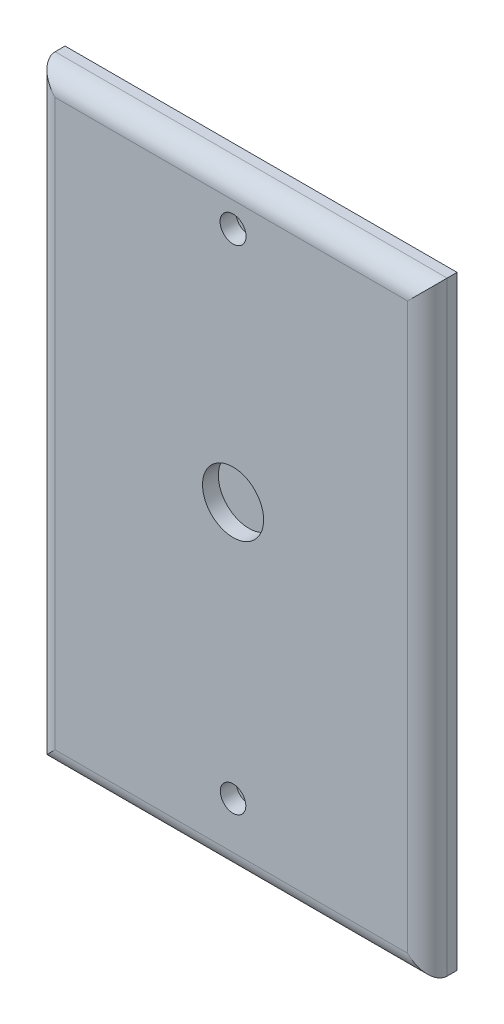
ISO-10303-21;
HEADER;
FILE_DESCRIPTION(('STEP AP214'),'2;1');
FILE_NAME('part.step','',(''),(''),'','','');
FILE_SCHEMA(('AUTOMOTIVE_DESIGN { 1 0 10303 214 1 1 1 1 }'));
ENDSEC;
DATA;
#1=APPLICATION_CONTEXT('core data for automotive mechanical design processes');
#2=APPLICATION_PROTOCOL_DEFINITION('international standard','automotive_design',2000,#1);
#3=PRODUCT_CONTEXT('',#1,'mechanical');
#4=PRODUCT('Part','Part','',(#3));
#5=PRODUCT_RELATED_PRODUCT_CATEGORY('part','',(#4));
#6=PRODUCT_DEFINITION_FORMATION('','',#4);
#7=PRODUCT_DEFINITION_CONTEXT('part definition',#1,'design');
#8=PRODUCT_DEFINITION('design','',#6,#7);
#9=PRODUCT_DEFINITION_SHAPE('','',#8);
#10=(LENGTH_UNIT() NAMED_UNIT(*) SI_UNIT(.MILLI.,.METRE.));
#11=(NAMED_UNIT(*) PLANE_ANGLE_UNIT() SI_UNIT($,.RADIAN.));
#12=(NAMED_UNIT(*) SI_UNIT($,.STERADIAN.) SOLID_ANGLE_UNIT());
#13=UNCERTAINTY_MEASURE_WITH_UNIT(LENGTH_MEASURE(1.E-05),#10,'distance_accuracy_value','');
#14=(GEOMETRIC_REPRESENTATION_CONTEXT(3) GLOBAL_UNCERTAINTY_ASSIGNED_CONTEXT((#13)) GLOBAL_UNIT_ASSIGNED_CONTEXT((#10,
#11,#12)) REPRESENTATION_CONTEXT('',''));
#15=CARTESIAN_POINT('',(0.,0.,0.));
#16=DIRECTION('',(0.,0.,1.));
#17=DIRECTION('',(1.,0.,0.));
#18=AXIS2_PLACEMENT_3D('',#15,#16,#17);
#19=CARTESIAN_POINT('',(-114.429040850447,144.440384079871,15.24));
#20=DIRECTION('',(1.,0.,0.));
#21=DIRECTION('',(0.,1.,0.));
#22=AXIS2_PLACEMENT_3D('',#19,#20,#21);
#23=PLANE('',#22);
#24=DIRECTION('',(0.,0.,-1.));
#25=VECTOR('',#24,1.);
#26=CARTESIAN_POINT('',(-114.429040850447,-165.871751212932,15.24));
#27=LINE('',#26,#25);
#28=CARTESIAN_POINT('',(-114.429040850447,-165.871751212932,5.08));
#29=VERTEX_POINT('',#28);
#30=CARTESIAN_POINT('',(-114.429040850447,-165.871751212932,0.));
#31=VERTEX_POINT('',#30);
#32=EDGE_CURVE('E84',#29,#31,#27,.T.);
#33=ORIENTED_EDGE('',*,*,#32,.F.);
#34=DIRECTION('',(0.,-1.,0.));
#35=VECTOR('',#34,1.);
#36=CARTESIAN_POINT('',(-114.429040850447,144.440384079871,5.08));
#37=LINE('',#36,#35);
#38=CARTESIAN_POINT('',(-114.429040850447,144.440384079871,5.08));
#39=VERTEX_POINT('',#38);
#40=EDGE_CURVE('E130',#29,#39,#37,.F.);
#41=ORIENTED_EDGE('',*,*,#40,.T.);
#42=DIRECTION('',(0.,0.,-1.));
#43=VECTOR('',#42,1.);
#44=CARTESIAN_POINT('',(-114.429040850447,144.440384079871,15.24));
#45=LINE('',#44,#43);
#46=CARTESIAN_POINT('',(-114.429040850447,144.440384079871,0.));
#47=VERTEX_POINT('',#46);
#48=EDGE_CURVE('E106',#39,#47,#45,.T.);
#49=ORIENTED_EDGE('',*,*,#48,.T.);
#50=DIRECTION('',(0.,-1.,0.));
#51=VECTOR('',#50,1.);
#52=CARTESIAN_POINT('',(-114.429040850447,144.440384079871,0.));
#53=LINE('',#52,#51);
#54=EDGE_CURVE('E102',#47,#31,#53,.T.);
#55=ORIENTED_EDGE('',*,*,#54,.T.);
#56=EDGE_LOOP('',(#33,#41,#49,#55));
#57=FACE_BOUND('',#56,.T.);
#58=ADVANCED_FACE('F31',(#57),#23,.F.);
#59=CARTESIAN_POINT('',(-114.429040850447,-165.871751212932,15.24));
#60=DIRECTION('',(0.,1.,0.));
#61=DIRECTION('',(0.,0.,1.));
#62=AXIS2_PLACEMENT_3D('',#59,#60,#61);
#63=PLANE('',#62);
#64=DIRECTION('',(0.,0.,-1.));
#65=VECTOR('',#64,1.);
#66=CARTESIAN_POINT('',(86.803470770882,-165.871751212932,15.24));
#67=LINE('',#66,#65);
#68=CARTESIAN_POINT('',(86.803470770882,-165.871751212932,5.08));
#69=VERTEX_POINT('',#68);
#70=CARTESIAN_POINT('',(86.803470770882,-165.871751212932,0.));
#71=VERTEX_POINT('',#70);
#72=EDGE_CURVE('E96',#69,#71,#67,.T.);
#73=ORIENTED_EDGE('',*,*,#72,.F.);
#74=DIRECTION('',(1.,0.,0.));
#75=VECTOR('',#74,1.);
#76=CARTESIAN_POINT('',(-114.429040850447,-165.871751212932,5.08));
#77=LINE('',#76,#75);
#78=EDGE_CURVE('E90',#69,#29,#77,.F.);
#79=ORIENTED_EDGE('',*,*,#78,.T.);
#80=ORIENTED_EDGE('',*,*,#32,.T.);
#81=DIRECTION('',(1.,0.,0.));
#82=VECTOR('',#81,1.);
#83=CARTESIAN_POINT('',(-114.429040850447,-165.871751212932,0.));
#84=LINE('',#83,#82);
#85=EDGE_CURVE('E87',#31,#71,#84,.T.);
#86=ORIENTED_EDGE('',*,*,#85,.T.);
#87=EDGE_LOOP('',(#73,#79,#80,#86));
#88=FACE_BOUND('',#87,.T.);
#89=ADVANCED_FACE('F86',(#88),#63,.F.);
#90=CARTESIAN_POINT('',(86.803470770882,144.440384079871,15.24));
#91=DIRECTION('',(-1.,0.,0.));
#92=DIRECTION('',(0.,0.,1.));
#93=AXIS2_PLACEMENT_3D('',#90,#91,#92);
#94=PLANE('',#93);
#95=DIRECTION('',(0.,0.,-1.));
#96=VECTOR('',#95,1.);
#97=CARTESIAN_POINT('',(86.803470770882,144.440384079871,15.24));
#98=LINE('',#97,#96);
#99=CARTESIAN_POINT('',(86.803470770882,144.440384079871,5.08));
#100=VERTEX_POINT('',#99);
#101=CARTESIAN_POINT('',(86.803470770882,144.440384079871,0.));
#102=VERTEX_POINT('',#101);
#103=EDGE_CURVE('E119',#100,#102,#98,.T.);
#104=ORIENTED_EDGE('',*,*,#103,.F.);
#105=DIRECTION('',(0.,1.,0.));
#106=VECTOR('',#105,1.);
#107=CARTESIAN_POINT('',(86.803470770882,-165.871751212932,5.08));
#108=LINE('',#107,#106);
#109=EDGE_CURVE('E40',#100,#69,#108,.F.);
#110=ORIENTED_EDGE('',*,*,#109,.T.);
#111=ORIENTED_EDGE('',*,*,#72,.T.);
#112=DIRECTION('',(0.,1.,0.));
#113=VECTOR('',#112,1.);
#114=CARTESIAN_POINT('',(86.803470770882,144.440384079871,0.));
#115=LINE('',#114,#113);
#116=EDGE_CURVE('E104',#71,#102,#115,.T.);
#117=ORIENTED_EDGE('',*,*,#116,.T.);
#118=EDGE_LOOP('',(#104,#110,#111,#117));
#119=FACE_BOUND('',#118,.T.);
#120=ADVANCED_FACE('F191',(#119),#94,.F.);
#121=CARTESIAN_POINT('',(-114.429040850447,144.440384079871,15.24));
#122=DIRECTION('',(0.,-1.,0.));
#123=DIRECTION('',(0.,0.,-1.));
#124=AXIS2_PLACEMENT_3D('',#121,#122,#123);
#125=PLANE('',#124);
#126=ORIENTED_EDGE('',*,*,#48,.F.);
#127=DIRECTION('',(-1.,0.,0.));
#128=VECTOR('',#127,1.);
#129=CARTESIAN_POINT('',(86.803470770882,144.440384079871,5.08));
#130=LINE('',#129,#128);
#131=EDGE_CURVE('E11',#39,#100,#130,.F.);
#132=ORIENTED_EDGE('',*,*,#131,.T.);
#133=ORIENTED_EDGE('',*,*,#103,.T.);
#134=DIRECTION('',(-1.,0.,0.));
#135=VECTOR('',#134,1.);
#136=CARTESIAN_POINT('',(-114.429040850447,144.440384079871,0.));
#137=LINE('',#136,#135);
#138=EDGE_CURVE('E116',#102,#47,#137,.T.);
#139=ORIENTED_EDGE('',*,*,#138,.T.);
#140=EDGE_LOOP('',(#126,#132,#133,#139));
#141=FACE_BOUND('',#140,.T.);
#142=ADVANCED_FACE('F167',(#141),#125,.F.);
#143=CARTESIAN_POINT('',(-114.429040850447,-165.871751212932,15.24));
#144=DIRECTION('',(0.,0.,1.));
#145=DIRECTION('',(1.,0.,0.));
#146=AXIS2_PLACEMENT_3D('',#143,#144,#145);
#147=PLANE('',#146);
#148=DIRECTION('',(-1.,0.,0.));
#149=VECTOR('',#148,1.);
#150=CARTESIAN_POINT('',(-114.429040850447,134.280384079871,15.24));
#151=LINE('',#150,#149);
#152=CARTESIAN_POINT('',(76.643470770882,134.280384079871,15.24));
#153=VERTEX_POINT('',#152);
#154=CARTESIAN_POINT('',(-104.269040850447,134.280384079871,15.24));
#155=VERTEX_POINT('',#154);
#156=EDGE_CURVE('E95',#153,#155,#151,.T.);
#157=ORIENTED_EDGE('',*,*,#156,.T.);
#158=DIRECTION('',(0.,-1.,0.));
#159=VECTOR('',#158,1.);
#160=CARTESIAN_POINT('',(-104.269040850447,-165.871751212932,15.24));
#161=LINE('',#160,#159);
#162=CARTESIAN_POINT('',(-104.269040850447,-155.711751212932,15.24));
#163=VERTEX_POINT('',#162);
#164=EDGE_CURVE('E127',#155,#163,#161,.T.);
#165=ORIENTED_EDGE('',*,*,#164,.T.);
#166=DIRECTION('',(1.,0.,0.));
#167=VECTOR('',#166,1.);
#168=CARTESIAN_POINT('',(86.803470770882,-155.711751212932,15.24));
#169=LINE('',#168,#167);
#170=CARTESIAN_POINT('',(76.643470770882,-155.711751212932,15.24));
#171=VERTEX_POINT('',#170);
#172=EDGE_CURVE('E125',#163,#171,#169,.T.);
#173=ORIENTED_EDGE('',*,*,#172,.T.);
#174=DIRECTION('',(0.,1.,0.));
#175=VECTOR('',#174,1.);
#176=CARTESIAN_POINT('',(76.643470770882,144.440384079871,15.24));
#177=LINE('',#176,#175);
#178=EDGE_CURVE('E123',#171,#153,#177,.T.);
#179=ORIENTED_EDGE('',*,*,#178,.T.);
#180=EDGE_LOOP('',(#157,#165,#173,#179));
#181=FACE_BOUND('',#180,.T.);
#182=CARTESIAN_POINT('',(-12.9354259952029,0.,15.24));
#183=DIRECTION('',(0.,0.,1.));
#184=DIRECTION('',(1.,0.,0.));
#185=AXIS2_PLACEMENT_3D('',#182,#183,#184);
#186=CIRCLE('',#185,15.6783642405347);
#187=CARTESIAN_POINT('',(2.7429382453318,0.,15.24));
#188=VERTEX_POINT('',#187);
#189=EDGE_CURVE('E143',#188,#188,#186,.T.);
#190=ORIENTED_EDGE('',*,*,#189,.F.);
#191=EDGE_LOOP('',(#190));
#192=FACE_BOUND('',#191,.T.);
#193=CARTESIAN_POINT('',(-12.9354259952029,-131.710621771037,15.24));
#194=DIRECTION('',(0.,0.,1.));
#195=DIRECTION('',(1.,0.,0.));
#196=AXIS2_PLACEMENT_3D('',#193,#194,#195);
#197=CIRCLE('',#196,6.54884368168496);
#198=CARTESIAN_POINT('',(-6.38658231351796,-131.710621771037,15.24));
#199=VERTEX_POINT('',#198);
#200=EDGE_CURVE('E153',#199,#199,#197,.T.);
#201=ORIENTED_EDGE('',*,*,#200,.F.);
#202=EDGE_LOOP('',(#201));
#203=FACE_BOUND('',#202,.T.);
#204=CARTESIAN_POINT('',(-12.9354259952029,121.483730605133,15.24));
#205=DIRECTION('',(0.,0.,1.));
#206=DIRECTION('',(1.,0.,0.));
#207=AXIS2_PLACEMENT_3D('',#204,#205,#206);
#208=CIRCLE('',#207,6.67270718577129);
#209=CARTESIAN_POINT('',(-6.26271880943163,121.483730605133,15.24));
#210=VERTEX_POINT('',#209);
#211=EDGE_CURVE('E111',#210,#210,#208,.T.);
#212=ORIENTED_EDGE('',*,*,#211,.F.);
#213=EDGE_LOOP('',(#212));
#214=FACE_BOUND('',#213,.T.);
#215=ADVANCED_FACE('F164',(#181,#192,#203,#214),#147,.T.);
#216=CARTESIAN_POINT('',(-114.429040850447,-165.871751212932,0.));
#217=DIRECTION('',(0.,0.,1.));
#218=DIRECTION('',(1.,0.,0.));
#219=AXIS2_PLACEMENT_3D('',#216,#217,#218);
#220=PLANE('',#219);
#221=ORIENTED_EDGE('',*,*,#54,.F.);
#222=ORIENTED_EDGE('',*,*,#138,.F.);
#223=ORIENTED_EDGE('',*,*,#116,.F.);
#224=ORIENTED_EDGE('',*,*,#85,.F.);
#225=EDGE_LOOP('',(#221,#222,#223,#224));
#226=FACE_BOUND('',#225,.T.);
#227=ADVANCED_FACE('F100',(#226),#220,.F.);
#228=CARTESIAN_POINT('',(-12.9354259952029,121.483730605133,7.11199999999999));
#229=DIRECTION('',(0.,0.,1.));
#230=DIRECTION('',(1.,0.,0.));
#231=AXIS2_PLACEMENT_3D('',#228,#229,#230);
#232=CYLINDRICAL_SURFACE('',#231,6.67270718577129);
#233=CARTESIAN_POINT('',(-12.9354259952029,121.483730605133,7.11199999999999));
#234=DIRECTION('',(0.,0.,1.));
#235=DIRECTION('',(1.,0.,0.));
#236=AXIS2_PLACEMENT_3D('',#233,#234,#235);
#237=CIRCLE('',#236,6.67270718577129);
#238=CARTESIAN_POINT('',(-6.26271880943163,121.483730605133,7.11199999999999));
#239=VERTEX_POINT('',#238);
#240=EDGE_CURVE('E108',#239,#239,#237,.T.);
#241=ORIENTED_EDGE('',*,*,#240,.F.);
#242=EDGE_LOOP('',(#241));
#243=FACE_BOUND('',#242,.T.);
#244=ORIENTED_EDGE('',*,*,#211,.T.);
#245=EDGE_LOOP('',(#244));
#246=FACE_BOUND('',#245,.T.);
#247=ADVANCED_FACE('F173',(#243,#246),#232,.F.);
#248=CARTESIAN_POINT('',(-12.9354259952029,121.483730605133,7.11199999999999));
#249=DIRECTION('',(0.,0.,1.));
#250=DIRECTION('',(1.,0.,0.));
#251=AXIS2_PLACEMENT_3D('',#248,#249,#250);
#252=PLANE('',#251);
#253=ORIENTED_EDGE('',*,*,#240,.T.);
#254=EDGE_LOOP('',(#253));
#255=FACE_BOUND('',#254,.T.);
#256=ADVANCED_FACE('F175',(#255),#252,.T.);
#257=CARTESIAN_POINT('',(-12.9354259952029,-131.710621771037,7.11199999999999));
#258=DIRECTION('',(0.,0.,1.));
#259=DIRECTION('',(1.,0.,0.));
#260=AXIS2_PLACEMENT_3D('',#257,#258,#259);
#261=CYLINDRICAL_SURFACE('',#260,6.54884368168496);
#262=CARTESIAN_POINT('',(-12.9354259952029,-131.710621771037,7.11199999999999));
#263=DIRECTION('',(0.,0.,1.));
#264=DIRECTION('',(1.,0.,0.));
#265=AXIS2_PLACEMENT_3D('',#262,#263,#264);
#266=CIRCLE('',#265,6.54884368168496);
#267=CARTESIAN_POINT('',(-6.38658231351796,-131.710621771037,7.11199999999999));
#268=VERTEX_POINT('',#267);
#269=EDGE_CURVE('E156',#268,#268,#266,.T.);
#270=ORIENTED_EDGE('',*,*,#269,.F.);
#271=EDGE_LOOP('',(#270));
#272=FACE_BOUND('',#271,.T.);
#273=ORIENTED_EDGE('',*,*,#200,.T.);
#274=EDGE_LOOP('',(#273));
#275=FACE_BOUND('',#274,.T.);
#276=ADVANCED_FACE('F162',(#272,#275),#261,.F.);
#277=CARTESIAN_POINT('',(-12.9354259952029,-131.710621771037,7.11199999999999));
#278=DIRECTION('',(0.,0.,1.));
#279=DIRECTION('',(1.,0.,0.));
#280=AXIS2_PLACEMENT_3D('',#277,#278,#279);
#281=PLANE('',#280);
#282=ORIENTED_EDGE('',*,*,#269,.T.);
#283=EDGE_LOOP('',(#282));
#284=FACE_BOUND('',#283,.T.);
#285=ADVANCED_FACE('F252',(#284),#281,.T.);
#286=CARTESIAN_POINT('',(-12.9354259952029,0.,7.11199999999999));
#287=DIRECTION('',(0.,0.,1.));
#288=DIRECTION('',(1.,0.,0.));
#289=AXIS2_PLACEMENT_3D('',#286,#287,#288);
#290=CYLINDRICAL_SURFACE('',#289,15.6783642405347);
#291=CARTESIAN_POINT('',(-12.9354259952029,0.,7.11199999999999));
#292=DIRECTION('',(0.,0.,1.));
#293=DIRECTION('',(1.,0.,0.));
#294=AXIS2_PLACEMENT_3D('',#291,#292,#293);
#295=CIRCLE('',#294,15.6783642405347);
#296=CARTESIAN_POINT('',(2.7429382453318,0.,7.11199999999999));
#297=VERTEX_POINT('',#296);
#298=EDGE_CURVE('E148',#297,#297,#295,.T.);
#299=ORIENTED_EDGE('',*,*,#298,.F.);
#300=EDGE_LOOP('',(#299));
#301=FACE_BOUND('',#300,.T.);
#302=ORIENTED_EDGE('',*,*,#189,.T.);
#303=EDGE_LOOP('',(#302));
#304=FACE_BOUND('',#303,.T.);
#305=ADVANCED_FACE('F211',(#301,#304),#290,.F.);
#306=CARTESIAN_POINT('',(-12.9354259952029,0.,7.11199999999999));
#307=DIRECTION('',(0.,0.,1.));
#308=DIRECTION('',(1.,0.,0.));
#309=AXIS2_PLACEMENT_3D('',#306,#307,#308);
#310=PLANE('',#309);
#311=ORIENTED_EDGE('',*,*,#298,.T.);
#312=EDGE_LOOP('',(#311));
#313=FACE_BOUND('',#312,.T.);
#314=ADVANCED_FACE('F206',(#313),#310,.T.);
#315=CARTESIAN_POINT('',(76.643470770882,-165.871751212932,5.08));
#316=DIRECTION('',(0.,-1.,0.));
#317=DIRECTION('',(0.,0.,-1.));
#318=AXIS2_PLACEMENT_3D('',#315,#316,#317);
#319=CYLINDRICAL_SURFACE('',#318,10.16);
#320=CARTESIAN_POINT('',(76.643470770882,-155.711751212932,5.08));
#321=DIRECTION('',(-0.707106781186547,-0.707106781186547,0.));
#322=DIRECTION('',(0.707106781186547,-0.707106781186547,0.));
#323=AXIS2_PLACEMENT_3D('',#320,#321,#322);
#324=ELLIPSE('',#323,14.3684097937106,10.16);
#325=EDGE_CURVE('E137',#69,#171,#324,.T.);
#326=ORIENTED_EDGE('',*,*,#325,.F.);
#327=ORIENTED_EDGE('',*,*,#109,.F.);
#328=CARTESIAN_POINT('',(76.643470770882,134.280384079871,5.08));
#329=DIRECTION('',(0.707106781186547,-0.707106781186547,0.));
#330=DIRECTION('',(0.707106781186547,0.707106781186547,0.));
#331=AXIS2_PLACEMENT_3D('',#328,#329,#330);
#332=ELLIPSE('',#331,14.3684097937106,10.16);
#333=EDGE_CURVE('E35',#153,#100,#332,.F.);
#334=ORIENTED_EDGE('',*,*,#333,.F.);
#335=ORIENTED_EDGE('',*,*,#178,.F.);
#336=EDGE_LOOP('',(#326,#327,#334,#335));
#337=FACE_BOUND('',#336,.T.);
#338=ADVANCED_FACE('F33',(#337),#319,.T.);
#339=CARTESIAN_POINT('',(-114.429040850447,134.280384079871,5.08));
#340=DIRECTION('',(1.,0.,0.));
#341=DIRECTION('',(0.,0.,-1.));
#342=AXIS2_PLACEMENT_3D('',#339,#340,#341);
#343=CYLINDRICAL_SURFACE('',#342,10.16);
#344=ORIENTED_EDGE('',*,*,#333,.T.);
#345=ORIENTED_EDGE('',*,*,#131,.F.);
#346=CARTESIAN_POINT('',(-104.269040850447,134.280384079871,5.08));
#347=DIRECTION('',(0.707106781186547,0.707106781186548,0.));
#348=DIRECTION('',(0.707106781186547,-0.707106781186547,0.));
#349=AXIS2_PLACEMENT_3D('',#346,#347,#348);
#350=ELLIPSE('',#349,14.3684097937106,10.16);
#351=EDGE_CURVE('E136',#155,#39,#350,.F.);
#352=ORIENTED_EDGE('',*,*,#351,.F.);
#353=ORIENTED_EDGE('',*,*,#156,.F.);
#354=EDGE_LOOP('',(#344,#345,#352,#353));
#355=FACE_BOUND('',#354,.T.);
#356=ADVANCED_FACE('F201',(#355),#343,.T.);
#357=CARTESIAN_POINT('',(-114.429040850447,-155.711751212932,5.08));
#358=DIRECTION('',(-1.,0.,0.));
#359=DIRECTION('',(0.,0.,1.));
#360=AXIS2_PLACEMENT_3D('',#357,#358,#359);
#361=CYLINDRICAL_SURFACE('',#360,10.16);
#362=ORIENTED_EDGE('',*,*,#325,.T.);
#363=ORIENTED_EDGE('',*,*,#172,.F.);
#364=CARTESIAN_POINT('',(-104.269040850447,-155.711751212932,5.08));
#365=DIRECTION('',(-0.707106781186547,0.707106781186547,0.));
#366=DIRECTION('',(-0.707106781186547,-0.707106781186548,0.));
#367=AXIS2_PLACEMENT_3D('',#364,#365,#366);
#368=ELLIPSE('',#367,14.3684097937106,10.16);
#369=EDGE_CURVE('E134',#29,#163,#368,.T.);
#370=ORIENTED_EDGE('',*,*,#369,.F.);
#371=ORIENTED_EDGE('',*,*,#78,.F.);
#372=EDGE_LOOP('',(#362,#363,#370,#371));
#373=FACE_BOUND('',#372,.T.);
#374=ADVANCED_FACE('F198',(#373),#361,.T.);
#375=CARTESIAN_POINT('',(-104.269040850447,-165.871751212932,5.08));
#376=DIRECTION('',(0.,1.,0.));
#377=DIRECTION('',(-1.,0.,0.));
#378=AXIS2_PLACEMENT_3D('',#375,#376,#377);
#379=CYLINDRICAL_SURFACE('',#378,10.16);
#380=ORIENTED_EDGE('',*,*,#351,.T.);
#381=ORIENTED_EDGE('',*,*,#40,.F.);
#382=ORIENTED_EDGE('',*,*,#369,.T.);
#383=ORIENTED_EDGE('',*,*,#164,.F.);
#384=EDGE_LOOP('',(#380,#381,#382,#383));
#385=FACE_BOUND('',#384,.T.);
#386=ADVANCED_FACE('F195',(#385),#379,.T.);
#387=CLOSED_SHELL('',(#58,#89,#120,#142,#215,#227,#247,#256,#276,#285,#305,#314,#338,#356,#374,#386));
#388=MANIFOLD_SOLID_BREP('B2',#387);
#389=ADVANCED_BREP_SHAPE_REPRESENTATION('',(#18,#388),#14);
#390=SHAPE_DEFINITION_REPRESENTATION(#9,#389);
ENDSEC;
END-ISO-10303-21;
